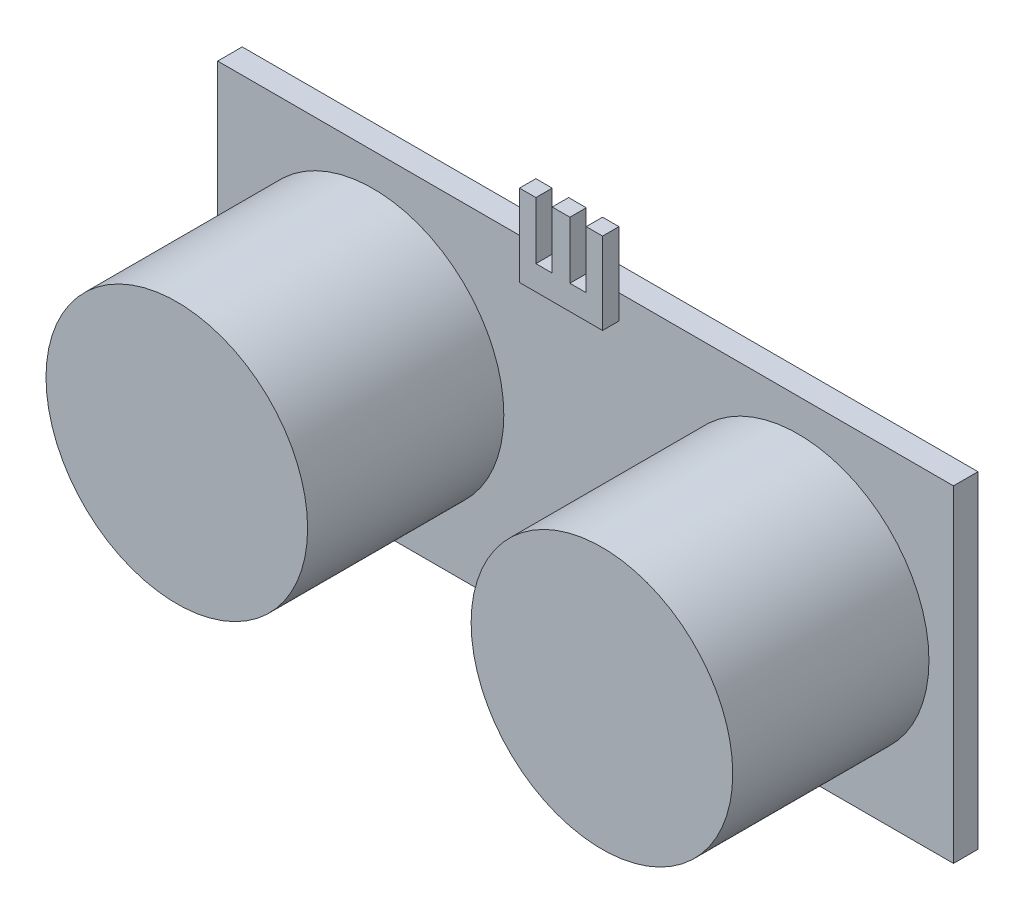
ISO-10303-21;
HEADER;
FILE_DESCRIPTION(('STEP AP214'),'2;1');
FILE_NAME('part.step','',(''),(''),'','','');
FILE_SCHEMA(('AUTOMOTIVE_DESIGN { 1 0 10303 214 1 1 1 1 }'));
ENDSEC;
DATA;
#1=APPLICATION_CONTEXT('core data for automotive mechanical design processes');
#2=APPLICATION_PROTOCOL_DEFINITION('international standard','automotive_design',2000,#1);
#3=PRODUCT_CONTEXT('',#1,'mechanical');
#4=PRODUCT('Part','Part','',(#3));
#5=PRODUCT_RELATED_PRODUCT_CATEGORY('part','',(#4));
#6=PRODUCT_DEFINITION_FORMATION('','',#4);
#7=PRODUCT_DEFINITION_CONTEXT('part definition',#1,'design');
#8=PRODUCT_DEFINITION('design','',#6,#7);
#9=PRODUCT_DEFINITION_SHAPE('','',#8);
#10=(LENGTH_UNIT() NAMED_UNIT(*) SI_UNIT(.MILLI.,.METRE.));
#11=(NAMED_UNIT(*) PLANE_ANGLE_UNIT() SI_UNIT($,.RADIAN.));
#12=(NAMED_UNIT(*) SI_UNIT($,.STERADIAN.) SOLID_ANGLE_UNIT());
#13=UNCERTAINTY_MEASURE_WITH_UNIT(LENGTH_MEASURE(1.E-05),#10,'distance_accuracy_value','');
#14=(GEOMETRIC_REPRESENTATION_CONTEXT(3) GLOBAL_UNCERTAINTY_ASSIGNED_CONTEXT((#13)) GLOBAL_UNIT_ASSIGNED_CONTEXT((#10,
#11,#12)) REPRESENTATION_CONTEXT('',''));
#15=CARTESIAN_POINT('',(0.,0.,0.));
#16=DIRECTION('',(0.,0.,1.));
#17=DIRECTION('',(1.,0.,0.));
#18=AXIS2_PLACEMENT_3D('',#15,#16,#17);
#19=CARTESIAN_POINT('',(0.,0.,1.5));
#20=DIRECTION('',(0.,0.,1.));
#21=DIRECTION('',(1.,0.,0.));
#22=AXIS2_PLACEMENT_3D('',#19,#20,#21);
#23=PLANE('',#22);
#24=DIRECTION('',(-1.,0.,0.));
#25=VECTOR('',#24,1.);
#26=CARTESIAN_POINT('',(-22.4999999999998,10.0000000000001,1.5));
#27=LINE('',#26,#25);
#28=CARTESIAN_POINT('',(2.04000000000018,10.0000000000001,1.5));
#29=VERTEX_POINT('',#28);
#30=CARTESIAN_POINT('',(1.04000000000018,10.0000000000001,1.5));
#31=VERTEX_POINT('',#30);
#32=EDGE_CURVE('E312',#29,#31,#27,.T.);
#33=ORIENTED_EDGE('',*,*,#32,.T.);
#34=DIRECTION('',(0.,-1.,0.));
#35=VECTOR('',#34,1.);
#36=CARTESIAN_POINT('',(1.04000000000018,10.0000000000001,1.5));
#37=LINE('',#36,#35);
#38=CARTESIAN_POINT('',(1.04000000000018,13.5,1.5));
#39=VERTEX_POINT('',#38);
#40=EDGE_CURVE('E171',#39,#31,#37,.T.);
#41=ORIENTED_EDGE('',*,*,#40,.F.);
#42=DIRECTION('',(-1.,0.,0.));
#43=VECTOR('',#42,1.);
#44=CARTESIAN_POINT('',(-3.03999999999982,13.5,1.5));
#45=LINE('',#44,#43);
#46=CARTESIAN_POINT('',(2.04000000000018,13.5,1.5));
#47=VERTEX_POINT('',#46);
#48=EDGE_CURVE('E259',#47,#39,#45,.T.);
#49=ORIENTED_EDGE('',*,*,#48,.F.);
#50=DIRECTION('',(0.,1.,0.));
#51=VECTOR('',#50,1.);
#52=CARTESIAN_POINT('',(2.04000000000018,13.5,1.5));
#53=LINE('',#52,#51);
#54=EDGE_CURVE('E203',#29,#47,#53,.T.);
#55=ORIENTED_EDGE('',*,*,#54,.F.);
#56=EDGE_LOOP('',(#33,#41,#49,#55));
#57=FACE_BOUND('',#56,.T.);
#58=ADVANCED_FACE('F45',(#57),#23,.F.);
#59=CARTESIAN_POINT('',(0.0400000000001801,13.5,1.5));
#60=VERTEX_POINT('',#59);
#61=CARTESIAN_POINT('',(-1.03999999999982,13.5,1.5));
#62=VERTEX_POINT('',#61);
#63=EDGE_CURVE('E264',#60,#62,#45,.T.);
#64=ORIENTED_EDGE('',*,*,#63,.F.);
#65=DIRECTION('',(0.,1.,0.));
#66=VECTOR('',#65,1.);
#67=CARTESIAN_POINT('',(0.0400000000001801,10.0000000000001,1.5));
#68=LINE('',#67,#66);
#69=CARTESIAN_POINT('',(0.0400000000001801,10.0000000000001,1.5));
#70=VERTEX_POINT('',#69);
#71=EDGE_CURVE('E190',#70,#60,#68,.T.);
#72=ORIENTED_EDGE('',*,*,#71,.F.);
#73=CARTESIAN_POINT('',(-1.03999999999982,10.0000000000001,1.5));
#74=VERTEX_POINT('',#73);
#75=EDGE_CURVE('E367',#70,#74,#27,.T.);
#76=ORIENTED_EDGE('',*,*,#75,.T.);
#77=DIRECTION('',(0.,-1.,0.));
#78=VECTOR('',#77,1.);
#79=CARTESIAN_POINT('',(-1.03999999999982,10.0000000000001,1.5));
#80=LINE('',#79,#78);
#81=EDGE_CURVE('E198',#62,#74,#80,.T.);
#82=ORIENTED_EDGE('',*,*,#81,.F.);
#83=EDGE_LOOP('',(#64,#72,#76,#82));
#84=FACE_BOUND('',#83,.T.);
#85=ADVANCED_FACE('F376',(#84),#23,.F.);
#86=CARTESIAN_POINT('',(-3.03999999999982,13.5,2.5));
#87=DIRECTION('',(0.,-1.,0.));
#88=DIRECTION('',(0.,0.,-1.));
#89=AXIS2_PLACEMENT_3D('',#86,#87,#88);
#90=PLANE('',#89);
#91=ORIENTED_EDGE('',*,*,#48,.T.);
#92=DIRECTION('',(0.,0.,-1.));
#93=VECTOR('',#92,1.);
#94=CARTESIAN_POINT('',(1.04000000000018,13.5,2.5));
#95=LINE('',#94,#93);
#96=CARTESIAN_POINT('',(1.04000000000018,13.5,2.5));
#97=VERTEX_POINT('',#96);
#98=EDGE_CURVE('E200',#97,#39,#95,.T.);
#99=ORIENTED_EDGE('',*,*,#98,.F.);
#100=DIRECTION('',(-1.,0.,0.));
#101=VECTOR('',#100,1.);
#102=CARTESIAN_POINT('',(-3.03999999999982,13.5,2.5));
#103=LINE('',#102,#101);
#104=CARTESIAN_POINT('',(2.04000000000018,13.5,2.5));
#105=VERTEX_POINT('',#104);
#106=EDGE_CURVE('E188',#105,#97,#103,.T.);
#107=ORIENTED_EDGE('',*,*,#106,.F.);
#108=DIRECTION('',(0.,0.,-1.));
#109=VECTOR('',#108,1.);
#110=CARTESIAN_POINT('',(2.04000000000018,13.5,2.5));
#111=LINE('',#110,#109);
#112=EDGE_CURVE('E280',#105,#47,#111,.T.);
#113=ORIENTED_EDGE('',*,*,#112,.T.);
#114=EDGE_LOOP('',(#91,#99,#107,#113));
#115=FACE_BOUND('',#114,.T.);
#116=ADVANCED_FACE('F408',(#115),#90,.F.);
#117=CARTESIAN_POINT('',(0.0400000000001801,13.5,2.5));
#118=VERTEX_POINT('',#117);
#119=CARTESIAN_POINT('',(-1.03999999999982,13.5,2.5));
#120=VERTEX_POINT('',#119);
#121=EDGE_CURVE('E247',#118,#120,#103,.T.);
#122=ORIENTED_EDGE('',*,*,#121,.F.);
#123=DIRECTION('',(0.,0.,-1.));
#124=VECTOR('',#123,1.);
#125=CARTESIAN_POINT('',(0.0400000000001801,13.5,2.5));
#126=LINE('',#125,#124);
#127=EDGE_CURVE('E204',#118,#60,#126,.T.);
#128=ORIENTED_EDGE('',*,*,#127,.T.);
#129=ORIENTED_EDGE('',*,*,#63,.T.);
#130=DIRECTION('',(0.,0.,-1.));
#131=VECTOR('',#130,1.);
#132=CARTESIAN_POINT('',(-1.03999999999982,13.5,2.5));
#133=LINE('',#132,#131);
#134=EDGE_CURVE('E220',#120,#62,#133,.T.);
#135=ORIENTED_EDGE('',*,*,#134,.F.);
#136=EDGE_LOOP('',(#122,#128,#129,#135));
#137=FACE_BOUND('',#136,.T.);
#138=ADVANCED_FACE('F385',(#137),#90,.F.);
#139=CARTESIAN_POINT('',(0.,0.,1.5));
#140=DIRECTION('',(0.,0.,1.));
#141=DIRECTION('',(1.,0.,0.));
#142=AXIS2_PLACEMENT_3D('',#139,#140,#141);
#143=PLANE('',#142);
#144=CARTESIAN_POINT('',(-13.,0.,1.5));
#145=DIRECTION('',(0.,0.,1.));
#146=DIRECTION('',(1.,0.,0.));
#147=AXIS2_PLACEMENT_3D('',#144,#145,#146);
#148=CIRCLE('',#147,8.00000000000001);
#149=CARTESIAN_POINT('',(-5.,0.,1.5));
#150=VERTEX_POINT('',#149);
#151=EDGE_CURVE('E290',#150,#150,#148,.T.);
#152=ORIENTED_EDGE('',*,*,#151,.F.);
#153=EDGE_LOOP('',(#152));
#154=FACE_BOUND('',#153,.T.);
#155=CARTESIAN_POINT('',(13.,0.,1.5));
#156=DIRECTION('',(0.,0.,1.));
#157=DIRECTION('',(1.,0.,0.));
#158=AXIS2_PLACEMENT_3D('',#155,#156,#157);
#159=CIRCLE('',#158,8.00000000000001);
#160=CARTESIAN_POINT('',(21.,0.,1.5));
#161=VERTEX_POINT('',#160);
#162=EDGE_CURVE('E294',#161,#161,#159,.T.);
#163=ORIENTED_EDGE('',*,*,#162,.F.);
#164=EDGE_LOOP('',(#163));
#165=FACE_BOUND('',#164,.T.);
#166=CARTESIAN_POINT('',(22.5000000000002,10.0000000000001,1.5));
#167=VERTEX_POINT('',#166);
#168=EDGE_CURVE('E307',#167,#29,#27,.T.);
#169=ORIENTED_EDGE('',*,*,#168,.T.);
#170=CARTESIAN_POINT('',(2.04000000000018,8.5,1.5));
#171=VERTEX_POINT('',#170);
#172=EDGE_CURVE('E254',#171,#29,#53,.T.);
#173=ORIENTED_EDGE('',*,*,#172,.F.);
#174=DIRECTION('',(1.,0.,0.));
#175=VECTOR('',#174,1.);
#176=CARTESIAN_POINT('',(-3.03999999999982,8.5,1.5));
#177=LINE('',#176,#175);
#178=CARTESIAN_POINT('',(-3.03999999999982,8.5,1.5));
#179=VERTEX_POINT('',#178);
#180=EDGE_CURVE('E243',#179,#171,#177,.T.);
#181=ORIENTED_EDGE('',*,*,#180,.F.);
#182=DIRECTION('',(0.,1.,0.));
#183=VECTOR('',#182,1.);
#184=CARTESIAN_POINT('',(-3.03999999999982,0.,1.5));
#185=LINE('',#184,#183);
#186=CARTESIAN_POINT('',(-3.03999999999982,10.0000000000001,1.5));
#187=VERTEX_POINT('',#186);
#188=EDGE_CURVE('E11',#179,#187,#185,.T.);
#189=ORIENTED_EDGE('',*,*,#188,.T.);
#190=CARTESIAN_POINT('',(-22.4999999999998,10.0000000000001,1.5));
#191=VERTEX_POINT('',#190);
#192=EDGE_CURVE('E305',#187,#191,#27,.T.);
#193=ORIENTED_EDGE('',*,*,#192,.T.);
#194=DIRECTION('',(0.,-1.,0.));
#195=VECTOR('',#194,1.);
#196=CARTESIAN_POINT('',(-22.4999999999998,10.0000000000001,1.5));
#197=LINE('',#196,#195);
#198=CARTESIAN_POINT('',(-22.4999999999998,-9.99999999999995,1.5));
#199=VERTEX_POINT('',#198);
#200=EDGE_CURVE('E311',#191,#199,#197,.T.);
#201=ORIENTED_EDGE('',*,*,#200,.T.);
#202=DIRECTION('',(1.,0.,0.));
#203=VECTOR('',#202,1.);
#204=CARTESIAN_POINT('',(-22.4999999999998,-9.99999999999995,1.5));
#205=LINE('',#204,#203);
#206=CARTESIAN_POINT('',(22.5000000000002,-9.99999999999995,1.5));
#207=VERTEX_POINT('',#206);
#208=EDGE_CURVE('E316',#199,#207,#205,.T.);
#209=ORIENTED_EDGE('',*,*,#208,.T.);
#210=DIRECTION('',(0.,1.,0.));
#211=VECTOR('',#210,1.);
#212=CARTESIAN_POINT('',(22.5000000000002,10.0000000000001,1.5));
#213=LINE('',#212,#211);
#214=EDGE_CURVE('E301',#207,#167,#213,.T.);
#215=ORIENTED_EDGE('',*,*,#214,.T.);
#216=EDGE_LOOP('',(#169,#173,#181,#189,#193,#201,#209,#215));
#217=FACE_BOUND('',#216,.T.);
#218=ADVANCED_FACE('F361',(#154,#165,#217),#143,.T.);
#219=CARTESIAN_POINT('',(22.5000000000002,10.0000000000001,1.5));
#220=DIRECTION('',(-1.,0.,0.));
#221=DIRECTION('',(0.,-1.,0.));
#222=AXIS2_PLACEMENT_3D('',#219,#220,#221);
#223=PLANE('',#222);
#224=DIRECTION('',(0.,1.,0.));
#225=VECTOR('',#224,1.);
#226=CARTESIAN_POINT('',(22.5000000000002,10.0000000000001,0.));
#227=LINE('',#226,#225);
#228=CARTESIAN_POINT('',(22.5000000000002,-9.99999999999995,0.));
#229=VERTEX_POINT('',#228);
#230=CARTESIAN_POINT('',(22.5000000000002,10.0000000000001,0.));
#231=VERTEX_POINT('',#230);
#232=EDGE_CURVE('E289',#229,#231,#227,.T.);
#233=ORIENTED_EDGE('',*,*,#232,.T.);
#234=DIRECTION('',(0.,0.,-1.));
#235=VECTOR('',#234,1.);
#236=CARTESIAN_POINT('',(22.5000000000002,10.0000000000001,1.5));
#237=LINE('',#236,#235);
#238=EDGE_CURVE('E54',#167,#231,#237,.T.);
#239=ORIENTED_EDGE('',*,*,#238,.F.);
#240=ORIENTED_EDGE('',*,*,#214,.F.);
#241=DIRECTION('',(0.,0.,-1.));
#242=VECTOR('',#241,1.);
#243=CARTESIAN_POINT('',(22.5000000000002,-9.99999999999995,1.5));
#244=LINE('',#243,#242);
#245=EDGE_CURVE('E319',#207,#229,#244,.T.);
#246=ORIENTED_EDGE('',*,*,#245,.T.);
#247=EDGE_LOOP('',(#233,#239,#240,#246));
#248=FACE_BOUND('',#247,.T.);
#249=ADVANCED_FACE('F47',(#248),#223,.F.);
#250=CARTESIAN_POINT('',(-22.4999999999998,10.0000000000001,1.5));
#251=DIRECTION('',(0.,-1.,0.));
#252=DIRECTION('',(0.,0.,-1.));
#253=AXIS2_PLACEMENT_3D('',#250,#251,#252);
#254=PLANE('',#253);
#255=DIRECTION('',(-1.,0.,0.));
#256=VECTOR('',#255,1.);
#257=CARTESIAN_POINT('',(-22.4999999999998,10.0000000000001,0.));
#258=LINE('',#257,#256);
#259=CARTESIAN_POINT('',(-22.4999999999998,10.0000000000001,0.));
#260=VERTEX_POINT('',#259);
#261=EDGE_CURVE('E323',#231,#260,#258,.T.);
#262=ORIENTED_EDGE('',*,*,#261,.T.);
#263=DIRECTION('',(0.,0.,-1.));
#264=VECTOR('',#263,1.);
#265=CARTESIAN_POINT('',(-22.4999999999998,10.0000000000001,1.5));
#266=LINE('',#265,#264);
#267=EDGE_CURVE('E338',#191,#260,#266,.T.);
#268=ORIENTED_EDGE('',*,*,#267,.F.);
#269=ORIENTED_EDGE('',*,*,#192,.F.);
#270=CARTESIAN_POINT('',(-2.03999999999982,10.0000000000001,1.5));
#271=VERTEX_POINT('',#270);
#272=EDGE_CURVE('E313',#271,#187,#27,.T.);
#273=ORIENTED_EDGE('',*,*,#272,.F.);
#274=DIRECTION('',(0.,0.,-1.));
#275=VECTOR('',#274,1.);
#276=CARTESIAN_POINT('',(-2.03999999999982,10.0000000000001,2.5));
#277=LINE('',#276,#275);
#278=CARTESIAN_POINT('',(-2.03999999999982,10.0000000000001,2.5));
#279=VERTEX_POINT('',#278);
#280=EDGE_CURVE('E213',#279,#271,#277,.T.);
#281=ORIENTED_EDGE('',*,*,#280,.F.);
#282=DIRECTION('',(-1.,0.,0.));
#283=VECTOR('',#282,1.);
#284=CARTESIAN_POINT('',(-1.03999999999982,10.0000000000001,2.5));
#285=LINE('',#284,#283);
#286=CARTESIAN_POINT('',(-1.03999999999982,10.0000000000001,2.5));
#287=VERTEX_POINT('',#286);
#288=EDGE_CURVE('E232',#287,#279,#285,.T.);
#289=ORIENTED_EDGE('',*,*,#288,.F.);
#290=DIRECTION('',(0.,0.,-1.));
#291=VECTOR('',#290,1.);
#292=CARTESIAN_POINT('',(-1.03999999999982,10.0000000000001,2.5));
#293=LINE('',#292,#291);
#294=EDGE_CURVE('E210',#287,#74,#293,.T.);
#295=ORIENTED_EDGE('',*,*,#294,.T.);
#296=ORIENTED_EDGE('',*,*,#75,.F.);
#297=DIRECTION('',(0.,0.,-1.));
#298=VECTOR('',#297,1.);
#299=CARTESIAN_POINT('',(0.0400000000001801,10.0000000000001,2.5));
#300=LINE('',#299,#298);
#301=CARTESIAN_POINT('',(0.0400000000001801,10.0000000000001,2.5));
#302=VERTEX_POINT('',#301);
#303=EDGE_CURVE('E176',#302,#70,#300,.T.);
#304=ORIENTED_EDGE('',*,*,#303,.F.);
#305=DIRECTION('',(-1.,0.,0.));
#306=VECTOR('',#305,1.);
#307=CARTESIAN_POINT('',(1.04000000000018,10.0000000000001,2.5));
#308=LINE('',#307,#306);
#309=CARTESIAN_POINT('',(1.04000000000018,10.0000000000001,2.5));
#310=VERTEX_POINT('',#309);
#311=EDGE_CURVE('E179',#310,#302,#308,.T.);
#312=ORIENTED_EDGE('',*,*,#311,.F.);
#313=DIRECTION('',(0.,0.,-1.));
#314=VECTOR('',#313,1.);
#315=CARTESIAN_POINT('',(1.04000000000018,10.0000000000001,2.5));
#316=LINE('',#315,#314);
#317=EDGE_CURVE('E164',#310,#31,#316,.T.);
#318=ORIENTED_EDGE('',*,*,#317,.T.);
#319=ORIENTED_EDGE('',*,*,#32,.F.);
#320=ORIENTED_EDGE('',*,*,#168,.F.);
#321=ORIENTED_EDGE('',*,*,#238,.T.);
#322=EDGE_LOOP('',(#262,#268,#269,#273,#281,#289,#295,#296,#304,#312,#318,#319,#320,#321));
#323=FACE_BOUND('',#322,.T.);
#324=ADVANCED_FACE('F180',(#323),#254,.F.);
#325=CARTESIAN_POINT('',(-22.4999999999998,10.0000000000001,1.5));
#326=DIRECTION('',(1.,0.,0.));
#327=DIRECTION('',(0.,1.,0.));
#328=AXIS2_PLACEMENT_3D('',#325,#326,#327);
#329=PLANE('',#328);
#330=DIRECTION('',(0.,-1.,0.));
#331=VECTOR('',#330,1.);
#332=CARTESIAN_POINT('',(-22.4999999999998,10.0000000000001,0.));
#333=LINE('',#332,#331);
#334=CARTESIAN_POINT('',(-22.4999999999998,-9.99999999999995,0.));
#335=VERTEX_POINT('',#334);
#336=EDGE_CURVE('E326',#260,#335,#333,.T.);
#337=ORIENTED_EDGE('',*,*,#336,.T.);
#338=DIRECTION('',(0.,0.,-1.));
#339=VECTOR('',#338,1.);
#340=CARTESIAN_POINT('',(-22.4999999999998,-9.99999999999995,1.5));
#341=LINE('',#340,#339);
#342=EDGE_CURVE('E334',#199,#335,#341,.T.);
#343=ORIENTED_EDGE('',*,*,#342,.F.);
#344=ORIENTED_EDGE('',*,*,#200,.F.);
#345=ORIENTED_EDGE('',*,*,#267,.T.);
#346=EDGE_LOOP('',(#337,#343,#344,#345));
#347=FACE_BOUND('',#346,.T.);
#348=ADVANCED_FACE('F355',(#347),#329,.F.);
#349=CARTESIAN_POINT('',(-22.4999999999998,-9.99999999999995,1.5));
#350=DIRECTION('',(0.,1.,0.));
#351=DIRECTION('',(0.,0.,1.));
#352=AXIS2_PLACEMENT_3D('',#349,#350,#351);
#353=PLANE('',#352);
#354=DIRECTION('',(1.,0.,0.));
#355=VECTOR('',#354,1.);
#356=CARTESIAN_POINT('',(-22.4999999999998,-9.99999999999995,0.));
#357=LINE('',#356,#355);
#358=EDGE_CURVE('E306',#335,#229,#357,.T.);
#359=ORIENTED_EDGE('',*,*,#358,.T.);
#360=ORIENTED_EDGE('',*,*,#245,.F.);
#361=ORIENTED_EDGE('',*,*,#208,.F.);
#362=ORIENTED_EDGE('',*,*,#342,.T.);
#363=EDGE_LOOP('',(#359,#360,#361,#362));
#364=FACE_BOUND('',#363,.T.);
#365=ADVANCED_FACE('F359',(#364),#353,.F.);
#366=CARTESIAN_POINT('',(0.,0.,0.));
#367=DIRECTION('',(0.,0.,1.));
#368=DIRECTION('',(1.,0.,0.));
#369=AXIS2_PLACEMENT_3D('',#366,#367,#368);
#370=PLANE('',#369);
#371=ORIENTED_EDGE('',*,*,#232,.F.);
#372=ORIENTED_EDGE('',*,*,#358,.F.);
#373=ORIENTED_EDGE('',*,*,#336,.F.);
#374=ORIENTED_EDGE('',*,*,#261,.F.);
#375=EDGE_LOOP('',(#371,#372,#373,#374));
#376=FACE_BOUND('',#375,.T.);
#377=ADVANCED_FACE('F351',(#376),#370,.F.);
#378=CARTESIAN_POINT('',(13.,0.,13.5));
#379=DIRECTION('',(0.,0.,-1.));
#380=DIRECTION('',(-1.,0.,0.));
#381=AXIS2_PLACEMENT_3D('',#378,#379,#380);
#382=CYLINDRICAL_SURFACE('',#381,8.00000000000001);
#383=CARTESIAN_POINT('',(13.,0.,13.5));
#384=DIRECTION('',(0.,0.,1.));
#385=DIRECTION('',(1.,0.,0.));
#386=AXIS2_PLACEMENT_3D('',#383,#384,#385);
#387=CIRCLE('',#386,8.00000000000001);
#388=CARTESIAN_POINT('',(21.,0.,13.5));
#389=VERTEX_POINT('',#388);
#390=EDGE_CURVE('E284',#389,#389,#387,.T.);
#391=ORIENTED_EDGE('',*,*,#390,.F.);
#392=EDGE_LOOP('',(#391));
#393=FACE_BOUND('',#392,.T.);
#394=ORIENTED_EDGE('',*,*,#162,.T.);
#395=EDGE_LOOP('',(#394));
#396=FACE_BOUND('',#395,.T.);
#397=ADVANCED_FACE('F460',(#393,#396),#382,.T.);
#398=CARTESIAN_POINT('',(13.,0.,13.5));
#399=DIRECTION('',(0.,0.,1.));
#400=DIRECTION('',(1.,0.,0.));
#401=AXIS2_PLACEMENT_3D('',#398,#399,#400);
#402=PLANE('',#401);
#403=ORIENTED_EDGE('',*,*,#390,.T.);
#404=EDGE_LOOP('',(#403));
#405=FACE_BOUND('',#404,.T.);
#406=ADVANCED_FACE('F458',(#405),#402,.T.);
#407=CARTESIAN_POINT('',(-13.,0.,13.5));
#408=DIRECTION('',(0.,0.,-1.));
#409=DIRECTION('',(-1.,0.,0.));
#410=AXIS2_PLACEMENT_3D('',#407,#408,#409);
#411=CYLINDRICAL_SURFACE('',#410,8.00000000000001);
#412=CARTESIAN_POINT('',(-13.,0.,13.5));
#413=DIRECTION('',(0.,0.,1.));
#414=DIRECTION('',(1.,0.,0.));
#415=AXIS2_PLACEMENT_3D('',#412,#413,#414);
#416=CIRCLE('',#415,8.00000000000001);
#417=CARTESIAN_POINT('',(-5.,0.,13.5));
#418=VERTEX_POINT('',#417);
#419=EDGE_CURVE('E285',#418,#418,#416,.T.);
#420=ORIENTED_EDGE('',*,*,#419,.F.);
#421=EDGE_LOOP('',(#420));
#422=FACE_BOUND('',#421,.T.);
#423=ORIENTED_EDGE('',*,*,#151,.T.);
#424=EDGE_LOOP('',(#423));
#425=FACE_BOUND('',#424,.T.);
#426=ADVANCED_FACE('F433',(#422,#425),#411,.T.);
#427=CARTESIAN_POINT('',(-13.,0.,13.5));
#428=DIRECTION('',(0.,0.,1.));
#429=DIRECTION('',(1.,0.,0.));
#430=AXIS2_PLACEMENT_3D('',#427,#428,#429);
#431=PLANE('',#430);
#432=ORIENTED_EDGE('',*,*,#419,.T.);
#433=EDGE_LOOP('',(#432));
#434=FACE_BOUND('',#433,.T.);
#435=ADVANCED_FACE('F424',(#434),#431,.T.);
#436=CARTESIAN_POINT('',(-2.03999999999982,13.5,1.5));
#437=VERTEX_POINT('',#436);
#438=CARTESIAN_POINT('',(-3.03999999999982,13.5,1.5));
#439=VERTEX_POINT('',#438);
#440=EDGE_CURVE('E258',#437,#439,#45,.T.);
#441=ORIENTED_EDGE('',*,*,#440,.F.);
#442=DIRECTION('',(0.,1.,0.));
#443=VECTOR('',#442,1.);
#444=CARTESIAN_POINT('',(-2.03999999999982,10.0000000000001,1.5));
#445=LINE('',#444,#443);
#446=EDGE_CURVE('E223',#271,#437,#445,.T.);
#447=ORIENTED_EDGE('',*,*,#446,.F.);
#448=ORIENTED_EDGE('',*,*,#272,.T.);
#449=DIRECTION('',(0.,-1.,0.));
#450=VECTOR('',#449,1.);
#451=CARTESIAN_POINT('',(-3.03999999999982,13.5,1.5));
#452=LINE('',#451,#450);
#453=EDGE_CURVE('E263',#439,#187,#452,.T.);
#454=ORIENTED_EDGE('',*,*,#453,.F.);
#455=EDGE_LOOP('',(#441,#447,#448,#454));
#456=FACE_BOUND('',#455,.T.);
#457=ADVANCED_FACE('F416',(#456),#23,.F.);
#458=CARTESIAN_POINT('',(2.04000000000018,13.5,2.5));
#459=DIRECTION('',(-1.,0.,0.));
#460=DIRECTION('',(0.,-1.,0.));
#461=AXIS2_PLACEMENT_3D('',#458,#459,#460);
#462=PLANE('',#461);
#463=ORIENTED_EDGE('',*,*,#172,.T.);
#464=ORIENTED_EDGE('',*,*,#54,.T.);
#465=ORIENTED_EDGE('',*,*,#112,.F.);
#466=DIRECTION('',(0.,1.,0.));
#467=VECTOR('',#466,1.);
#468=CARTESIAN_POINT('',(2.04000000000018,13.5,2.5));
#469=LINE('',#468,#467);
#470=CARTESIAN_POINT('',(2.04000000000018,8.5,2.5));
#471=VERTEX_POINT('',#470);
#472=EDGE_CURVE('E239',#471,#105,#469,.T.);
#473=ORIENTED_EDGE('',*,*,#472,.F.);
#474=DIRECTION('',(0.,0.,-1.));
#475=VECTOR('',#474,1.);
#476=CARTESIAN_POINT('',(2.04000000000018,8.5,2.5));
#477=LINE('',#476,#475);
#478=EDGE_CURVE('E253',#471,#171,#477,.T.);
#479=ORIENTED_EDGE('',*,*,#478,.T.);
#480=EDGE_LOOP('',(#463,#464,#465,#473,#479));
#481=FACE_BOUND('',#480,.T.);
#482=ADVANCED_FACE('F405',(#481),#462,.F.);
#483=CARTESIAN_POINT('',(-2.03999999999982,13.5,2.5));
#484=VERTEX_POINT('',#483);
#485=CARTESIAN_POINT('',(-3.03999999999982,13.5,2.5));
#486=VERTEX_POINT('',#485);
#487=EDGE_CURVE('E242',#484,#486,#103,.T.);
#488=ORIENTED_EDGE('',*,*,#487,.F.);
#489=DIRECTION('',(0.,0.,-1.));
#490=VECTOR('',#489,1.);
#491=CARTESIAN_POINT('',(-2.03999999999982,13.5,2.5));
#492=LINE('',#491,#490);
#493=EDGE_CURVE('E216',#484,#437,#492,.T.);
#494=ORIENTED_EDGE('',*,*,#493,.T.);
#495=ORIENTED_EDGE('',*,*,#440,.T.);
#496=DIRECTION('',(0.,0.,-1.));
#497=VECTOR('',#496,1.);
#498=CARTESIAN_POINT('',(-3.03999999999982,13.5,2.5));
#499=LINE('',#498,#497);
#500=EDGE_CURVE('E276',#486,#439,#499,.T.);
#501=ORIENTED_EDGE('',*,*,#500,.F.);
#502=EDGE_LOOP('',(#488,#494,#495,#501));
#503=FACE_BOUND('',#502,.T.);
#504=ADVANCED_FACE('F393',(#503),#90,.F.);
#505=CARTESIAN_POINT('',(-3.03999999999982,13.5,2.5));
#506=DIRECTION('',(1.,0.,0.));
#507=DIRECTION('',(0.,1.,0.));
#508=AXIS2_PLACEMENT_3D('',#505,#506,#507);
#509=PLANE('',#508);
#510=ORIENTED_EDGE('',*,*,#453,.T.);
#511=ORIENTED_EDGE('',*,*,#188,.F.);
#512=DIRECTION('',(0.,0.,-1.));
#513=VECTOR('',#512,1.);
#514=CARTESIAN_POINT('',(-3.03999999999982,8.5,2.5));
#515=LINE('',#514,#513);
#516=CARTESIAN_POINT('',(-3.03999999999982,8.5,2.5));
#517=VERTEX_POINT('',#516);
#518=EDGE_CURVE('E273',#517,#179,#515,.T.);
#519=ORIENTED_EDGE('',*,*,#518,.F.);
#520=DIRECTION('',(0.,-1.,0.));
#521=VECTOR('',#520,1.);
#522=CARTESIAN_POINT('',(-3.03999999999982,13.5,2.5));
#523=LINE('',#522,#521);
#524=EDGE_CURVE('E246',#486,#517,#523,.T.);
#525=ORIENTED_EDGE('',*,*,#524,.F.);
#526=ORIENTED_EDGE('',*,*,#500,.T.);
#527=EDGE_LOOP('',(#510,#511,#519,#525,#526));
#528=FACE_BOUND('',#527,.T.);
#529=ADVANCED_FACE('F397',(#528),#509,.F.);
#530=CARTESIAN_POINT('',(-3.03999999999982,8.5,2.5));
#531=DIRECTION('',(0.,1.,0.));
#532=DIRECTION('',(0.,0.,1.));
#533=AXIS2_PLACEMENT_3D('',#530,#531,#532);
#534=PLANE('',#533);
#535=ORIENTED_EDGE('',*,*,#180,.T.);
#536=ORIENTED_EDGE('',*,*,#478,.F.);
#537=DIRECTION('',(1.,0.,0.));
#538=VECTOR('',#537,1.);
#539=CARTESIAN_POINT('',(-3.03999999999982,8.5,2.5));
#540=LINE('',#539,#538);
#541=EDGE_CURVE('E250',#517,#471,#540,.T.);
#542=ORIENTED_EDGE('',*,*,#541,.F.);
#543=ORIENTED_EDGE('',*,*,#518,.T.);
#544=EDGE_LOOP('',(#535,#536,#542,#543));
#545=FACE_BOUND('',#544,.T.);
#546=ADVANCED_FACE('F401',(#545),#534,.F.);
#547=CARTESIAN_POINT('',(0.,0.,2.5));
#548=DIRECTION('',(0.,0.,1.));
#549=DIRECTION('',(1.,0.,0.));
#550=AXIS2_PLACEMENT_3D('',#547,#548,#549);
#551=PLANE('',#550);
#552=DIRECTION('',(0.,-1.,0.));
#553=VECTOR('',#552,1.);
#554=CARTESIAN_POINT('',(1.04000000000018,10.0000000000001,2.5));
#555=LINE('',#554,#553);
#556=EDGE_CURVE('E168',#97,#310,#555,.T.);
#557=ORIENTED_EDGE('',*,*,#556,.T.);
#558=ORIENTED_EDGE('',*,*,#311,.T.);
#559=DIRECTION('',(0.,1.,0.));
#560=VECTOR('',#559,1.);
#561=CARTESIAN_POINT('',(0.0400000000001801,10.0000000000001,2.5));
#562=LINE('',#561,#560);
#563=EDGE_CURVE('E61',#302,#118,#562,.T.);
#564=ORIENTED_EDGE('',*,*,#563,.T.);
#565=ORIENTED_EDGE('',*,*,#121,.T.);
#566=DIRECTION('',(0.,-1.,0.));
#567=VECTOR('',#566,1.);
#568=CARTESIAN_POINT('',(-1.03999999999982,10.0000000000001,2.5));
#569=LINE('',#568,#567);
#570=EDGE_CURVE('E226',#120,#287,#569,.T.);
#571=ORIENTED_EDGE('',*,*,#570,.T.);
#572=ORIENTED_EDGE('',*,*,#288,.T.);
#573=DIRECTION('',(0.,1.,0.));
#574=VECTOR('',#573,1.);
#575=CARTESIAN_POINT('',(-2.03999999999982,10.0000000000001,2.5));
#576=LINE('',#575,#574);
#577=EDGE_CURVE('E69',#279,#484,#576,.T.);
#578=ORIENTED_EDGE('',*,*,#577,.T.);
#579=ORIENTED_EDGE('',*,*,#487,.T.);
#580=ORIENTED_EDGE('',*,*,#524,.T.);
#581=ORIENTED_EDGE('',*,*,#541,.T.);
#582=ORIENTED_EDGE('',*,*,#472,.T.);
#583=ORIENTED_EDGE('',*,*,#106,.T.);
#584=EDGE_LOOP('',(#557,#558,#564,#565,#571,#572,#578,#579,#580,#581,#582,#583));
#585=FACE_BOUND('',#584,.T.);
#586=ADVANCED_FACE('F186',(#585),#551,.T.);
#587=CARTESIAN_POINT('',(-1.03999999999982,10.0000000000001,2.5));
#588=DIRECTION('',(1.,0.,0.));
#589=DIRECTION('',(0.,0.,-1.));
#590=AXIS2_PLACEMENT_3D('',#587,#588,#589);
#591=PLANE('',#590);
#592=ORIENTED_EDGE('',*,*,#81,.T.);
#593=ORIENTED_EDGE('',*,*,#294,.F.);
#594=ORIENTED_EDGE('',*,*,#570,.F.);
#595=ORIENTED_EDGE('',*,*,#134,.T.);
#596=EDGE_LOOP('',(#592,#593,#594,#595));
#597=FACE_BOUND('',#596,.T.);
#598=ADVANCED_FACE('F380',(#597),#591,.F.);
#599=CARTESIAN_POINT('',(-2.03999999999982,10.0000000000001,2.5));
#600=DIRECTION('',(-1.,0.,0.));
#601=DIRECTION('',(0.,0.,1.));
#602=AXIS2_PLACEMENT_3D('',#599,#600,#601);
#603=PLANE('',#602);
#604=ORIENTED_EDGE('',*,*,#446,.T.);
#605=ORIENTED_EDGE('',*,*,#493,.F.);
#606=ORIENTED_EDGE('',*,*,#577,.F.);
#607=ORIENTED_EDGE('',*,*,#280,.T.);
#608=EDGE_LOOP('',(#604,#605,#606,#607));
#609=FACE_BOUND('',#608,.T.);
#610=ADVANCED_FACE('F437',(#609),#603,.F.);
#611=CARTESIAN_POINT('',(1.04000000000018,10.0000000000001,2.5));
#612=DIRECTION('',(1.,0.,0.));
#613=DIRECTION('',(0.,1.,0.));
#614=AXIS2_PLACEMENT_3D('',#611,#612,#613);
#615=PLANE('',#614);
#616=ORIENTED_EDGE('',*,*,#40,.T.);
#617=ORIENTED_EDGE('',*,*,#317,.F.);
#618=ORIENTED_EDGE('',*,*,#556,.F.);
#619=ORIENTED_EDGE('',*,*,#98,.T.);
#620=EDGE_LOOP('',(#616,#617,#618,#619));
#621=FACE_BOUND('',#620,.T.);
#622=ADVANCED_FACE('F166',(#621),#615,.F.);
#623=CARTESIAN_POINT('',(0.0400000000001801,10.0000000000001,2.5));
#624=DIRECTION('',(-1.,0.,0.));
#625=DIRECTION('',(0.,0.,1.));
#626=AXIS2_PLACEMENT_3D('',#623,#624,#625);
#627=PLANE('',#626);
#628=ORIENTED_EDGE('',*,*,#71,.T.);
#629=ORIENTED_EDGE('',*,*,#127,.F.);
#630=ORIENTED_EDGE('',*,*,#563,.F.);
#631=ORIENTED_EDGE('',*,*,#303,.T.);
#632=EDGE_LOOP('',(#628,#629,#630,#631));
#633=FACE_BOUND('',#632,.T.);
#634=ADVANCED_FACE('F444',(#633),#627,.F.);
#635=CLOSED_SHELL('',(#58,#85,#116,#138,#218,#249,#324,#348,#365,#377,#397,#406,#426,#435,#457,
#482,#504,#529,#546,#586,#598,#610,#622,#634));
#636=MANIFOLD_SOLID_BREP('B2',#635);
#637=ADVANCED_BREP_SHAPE_REPRESENTATION('',(#18,#636),#14);
#638=SHAPE_DEFINITION_REPRESENTATION(#9,#637);
ENDSEC;
END-ISO-10303-21;
